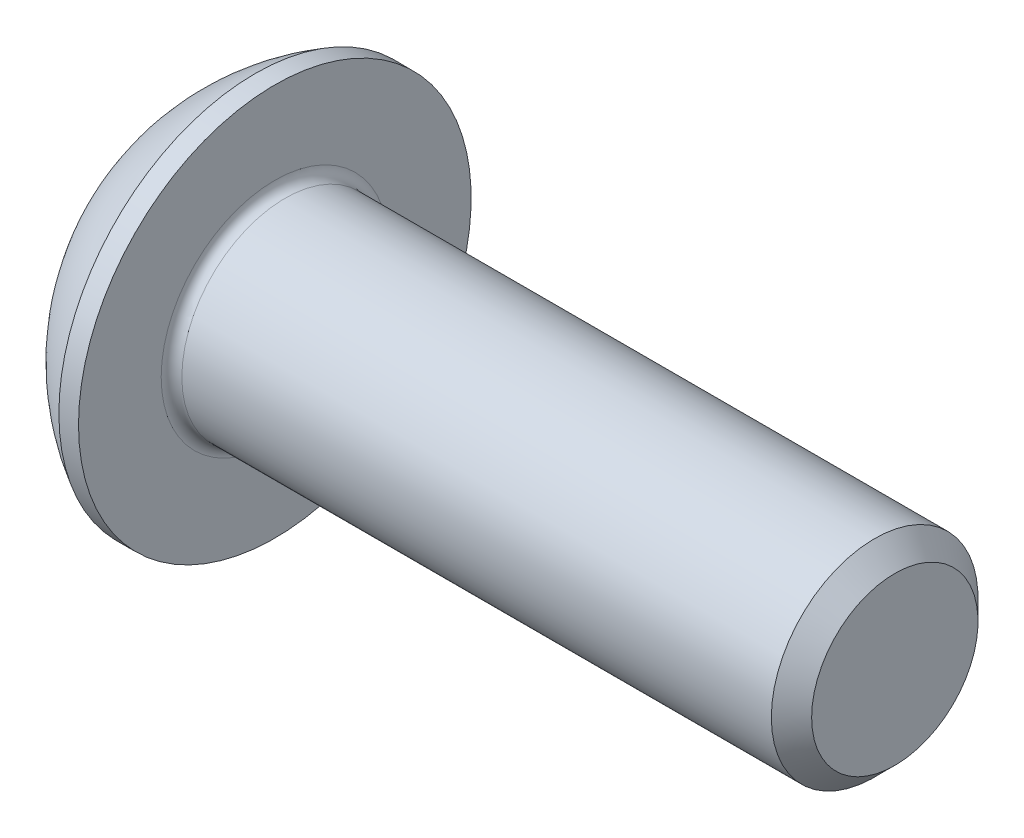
ISO-10303-21;
HEADER;
FILE_DESCRIPTION(('STEP AP214'),'2;1');
FILE_NAME('part.step','',(''),(''),'','','');
FILE_SCHEMA(('AUTOMOTIVE_DESIGN { 1 0 10303 214 1 1 1 1 }'));
ENDSEC;
DATA;
#1=APPLICATION_CONTEXT('core data for automotive mechanical design processes');
#2=APPLICATION_PROTOCOL_DEFINITION('international standard','automotive_design',2000,#1);
#3=PRODUCT_CONTEXT('',#1,'mechanical');
#4=PRODUCT('Part','Part','',(#3));
#5=PRODUCT_RELATED_PRODUCT_CATEGORY('part','',(#4));
#6=PRODUCT_DEFINITION_FORMATION('','',#4);
#7=PRODUCT_DEFINITION_CONTEXT('part definition',#1,'design');
#8=PRODUCT_DEFINITION('design','',#6,#7);
#9=PRODUCT_DEFINITION_SHAPE('','',#8);
#10=(LENGTH_UNIT() NAMED_UNIT(*) SI_UNIT(.MILLI.,.METRE.));
#11=(NAMED_UNIT(*) PLANE_ANGLE_UNIT() SI_UNIT($,.RADIAN.));
#12=(NAMED_UNIT(*) SI_UNIT($,.STERADIAN.) SOLID_ANGLE_UNIT());
#13=UNCERTAINTY_MEASURE_WITH_UNIT(LENGTH_MEASURE(1.E-05),#10,'distance_accuracy_value','');
#14=(GEOMETRIC_REPRESENTATION_CONTEXT(3) GLOBAL_UNCERTAINTY_ASSIGNED_CONTEXT((#13)) GLOBAL_UNIT_ASSIGNED_CONTEXT((#10,
#11,#12)) REPRESENTATION_CONTEXT('',''));
#15=CARTESIAN_POINT('',(0.,0.,0.));
#16=DIRECTION('',(0.,0.,1.));
#17=DIRECTION('',(1.,0.,0.));
#18=AXIS2_PLACEMENT_3D('',#15,#16,#17);
#19=CARTESIAN_POINT('',(0.,0.,0.));
#20=DIRECTION('',(-1.,0.,0.));
#21=DIRECTION('',(0.,0.,1.));
#22=AXIS2_PLACEMENT_3D('',#19,#20,#21);
#23=PLANE('',#22);
#24=CARTESIAN_POINT('',(0.,0.,0.));
#25=DIRECTION('',(-1.,0.,0.));
#26=DIRECTION('',(0.,0.,1.));
#27=AXIS2_PLACEMENT_3D('',#24,#25,#26);
#28=CIRCLE('',#27,1.9);
#29=CARTESIAN_POINT('',(0.,1.9,0.));
#30=VERTEX_POINT('',#29);
#31=EDGE_CURVE('E156',#30,#30,#28,.T.);
#32=ORIENTED_EDGE('',*,*,#31,.T.);
#33=EDGE_LOOP('',(#32));
#34=FACE_BOUND('',#33,.T.);
#35=DIRECTION('',(0.,-1.,0.));
#36=VECTOR('',#35,1.);
#37=CARTESIAN_POINT('',(0.,-0.721687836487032,1.25));
#38=LINE('',#37,#36);
#39=CARTESIAN_POINT('',(0.,0.721687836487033,1.25));
#40=VERTEX_POINT('',#39);
#41=CARTESIAN_POINT('',(0.,-0.721687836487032,1.25));
#42=VERTEX_POINT('',#41);
#43=EDGE_CURVE('E46',#40,#42,#38,.T.);
#44=ORIENTED_EDGE('',*,*,#43,.T.);
#45=DIRECTION('',(0.,-0.5,-0.866025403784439));
#46=VECTOR('',#45,1.);
#47=CARTESIAN_POINT('',(0.,-1.44337567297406,0.));
#48=LINE('',#47,#46);
#49=CARTESIAN_POINT('',(0.,-1.44337567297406,0.));
#50=VERTEX_POINT('',#49);
#51=EDGE_CURVE('E249',#42,#50,#48,.T.);
#52=ORIENTED_EDGE('',*,*,#51,.T.);
#53=DIRECTION('',(0.,0.5,-0.866025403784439));
#54=VECTOR('',#53,1.);
#55=CARTESIAN_POINT('',(0.,-0.721687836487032,-1.25));
#56=LINE('',#55,#54);
#57=CARTESIAN_POINT('',(0.,-0.721687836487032,-1.25));
#58=VERTEX_POINT('',#57);
#59=EDGE_CURVE('E131',#50,#58,#56,.T.);
#60=ORIENTED_EDGE('',*,*,#59,.T.);
#61=DIRECTION('',(0.,1.,0.));
#62=VECTOR('',#61,1.);
#63=CARTESIAN_POINT('',(0.,0.721687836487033,-1.25));
#64=LINE('',#63,#62);
#65=CARTESIAN_POINT('',(0.,0.721687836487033,-1.25));
#66=VERTEX_POINT('',#65);
#67=EDGE_CURVE('E252',#58,#66,#64,.T.);
#68=ORIENTED_EDGE('',*,*,#67,.T.);
#69=DIRECTION('',(0.,0.5,0.866025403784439));
#70=VECTOR('',#69,1.);
#71=CARTESIAN_POINT('',(0.,1.44337567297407,0.));
#72=LINE('',#71,#70);
#73=CARTESIAN_POINT('',(0.,1.44337567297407,0.));
#74=VERTEX_POINT('',#73);
#75=EDGE_CURVE('E254',#66,#74,#72,.T.);
#76=ORIENTED_EDGE('',*,*,#75,.T.);
#77=DIRECTION('',(0.,-0.5,0.866025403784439));
#78=VECTOR('',#77,1.);
#79=CARTESIAN_POINT('',(0.,0.721687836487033,1.25));
#80=LINE('',#79,#78);
#81=EDGE_CURVE('E256',#74,#40,#80,.T.);
#82=ORIENTED_EDGE('',*,*,#81,.T.);
#83=EDGE_LOOP('',(#44,#52,#60,#68,#76,#82));
#84=FACE_BOUND('',#83,.T.);
#85=ADVANCED_FACE('F31',(#34,#84),#23,.T.);
#86=CARTESIAN_POINT('',(3.88527472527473,0.,0.));
#87=DIRECTION('',(-1.,0.,0.));
#88=DIRECTION('',(0.,1.,0.));
#89=AXIS2_PLACEMENT_3D('',#86,#87,#88);
#90=SPHERICAL_SURFACE('',#89,4.3249693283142);
#91=CARTESIAN_POINT('',(1.82,0.,0.));
#92=DIRECTION('',(-1.,0.,0.));
#93=DIRECTION('',(0.,0.,1.));
#94=AXIS2_PLACEMENT_3D('',#91,#92,#93);
#95=CIRCLE('',#94,3.8);
#96=CARTESIAN_POINT('',(1.82,3.8,0.));
#97=VERTEX_POINT('',#96);
#98=EDGE_CURVE('E153',#97,#97,#95,.T.);
#99=CARTESIAN_POINT('',(1.82,3.8,0.));
#100=CARTESIAN_POINT('',(1.79553223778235,3.78670197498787,0.));
#101=CARTESIAN_POINT('',(1.77119294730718,3.77316757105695,0.));
#102=CARTESIAN_POINT('',(1.72278031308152,3.74563119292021,0.));
#103=CARTESIAN_POINT('',(1.69870696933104,3.7316292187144,0.));
#104=CARTESIAN_POINT('',(1.65083523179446,3.7031628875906,0.));
#105=CARTESIAN_POINT('',(1.62703683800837,3.6886985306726,0.));
#106=CARTESIAN_POINT('',(1.57972387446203,3.65931284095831,0.));
#107=CARTESIAN_POINT('',(1.55620930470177,3.64439150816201,0.));
#108=CARTESIAN_POINT('',(1.50947276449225,3.61409743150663,0.));
#109=CARTESIAN_POINT('',(1.48625079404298,3.59872468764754,0.));
#110=CARTESIAN_POINT('',(1.44010811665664,3.56753352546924,0.));
#111=CARTESIAN_POINT('',(1.41718740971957,3.55171510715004,0.));
#112=CARTESIAN_POINT('',(1.37165581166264,3.51963849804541,0.));
#113=CARTESIAN_POINT('',(1.34904492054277,3.50338030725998,0.));
#114=CARTESIAN_POINT('',(1.30414139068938,3.47043021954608,0.));
#115=CARTESIAN_POINT('',(1.28184875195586,3.4537383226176,0.));
#116=CARTESIAN_POINT('',(1.23759004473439,3.41992705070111,0.));
#117=CARTESIAN_POINT('',(1.21562397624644,3.40280767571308,0.));
#118=CARTESIAN_POINT('',(1.17202660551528,3.3681478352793,0.));
#119=CARTESIAN_POINT('',(1.15039530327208,3.35060736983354,0.));
#120=CARTESIAN_POINT('',(1.10747553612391,3.31511189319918,0.));
#121=CARTESIAN_POINT('',(1.08618707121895,3.29715688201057,0.));
#122=CARTESIAN_POINT('',(1.04396092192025,3.26083901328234,0.));
#123=CARTESIAN_POINT('',(1.02302323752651,3.24247615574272,0.));
#124=CARTESIAN_POINT('',(0.981506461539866,3.20534944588,0.));
#125=CARTESIAN_POINT('',(0.960927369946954,3.18658559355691,0.));
#126=CARTESIAN_POINT('',(0.920135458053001,3.14866389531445,0.));
#127=CARTESIAN_POINT('',(0.89992263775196,3.12950604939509,0.));
#128=CARTESIAN_POINT('',(0.859870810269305,3.09080351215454,0.));
#129=CARTESIAN_POINT('',(0.84003180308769,3.07125882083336,0.));
#130=CARTESIAN_POINT('',(0.800735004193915,3.0317898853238,0.));
#131=CARTESIAN_POINT('',(0.781277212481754,3.01186564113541,0.));
#132=CARTESIAN_POINT('',(0.742750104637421,2.97164503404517,0.));
#133=CARTESIAN_POINT('',(0.723680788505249,2.95134867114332,0.));
#134=CARTESIAN_POINT('',(0.685937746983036,2.91039139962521,0.));
#135=CARTESIAN_POINT('',(0.667264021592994,2.88973049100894,0.));
#136=CARTESIAN_POINT('',(0.630319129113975,2.84805183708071,0.));
#137=CARTESIAN_POINT('',(0.612047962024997,2.82703409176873,0.));
#138=CARTESIAN_POINT('',(0.575915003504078,2.78464960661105,0.));
#139=CARTESIAN_POINT('',(0.558053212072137,2.76328286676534,0.));
#140=CARTESIAN_POINT('',(0.52274566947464,2.72020836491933,0.));
#141=CARTESIAN_POINT('',(0.505299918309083,2.69850060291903,0.));
#142=CARTESIAN_POINT('',(0.470830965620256,2.65475215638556,0.));
#143=CARTESIAN_POINT('',(0.453807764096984,2.63271147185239,0.));
#144=CARTESIAN_POINT('',(0.420190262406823,2.58830540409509,0.));
#145=CARTESIAN_POINT('',(0.403595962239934,2.56594002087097,0.));
#146=CARTESIAN_POINT('',(0.370842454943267,2.52089290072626,0.));
#147=CARTESIAN_POINT('',(0.35468324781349,2.49821116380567,0.));
#148=CARTESIAN_POINT('',(0.322805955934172,2.45253979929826,0.));
#149=CARTESIAN_POINT('',(0.307087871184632,2.42955017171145,0.));
#150=CARTESIAN_POINT('',(0.276098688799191,2.38327160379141,0.));
#151=CARTESIAN_POINT('',(0.26082759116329,2.35998266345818,0.));
#152=CARTESIAN_POINT('',(0.230738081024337,2.31311415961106,0.));
#153=CARTESIAN_POINT('',(0.215919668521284,2.28953459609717,0.));
#154=CARTESIAN_POINT('',(0.186741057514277,2.24209364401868,0.));
#155=CARTESIAN_POINT('',(0.172380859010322,2.21823225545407,0.));
#156=CARTESIAN_POINT('',(0.144124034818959,2.17023655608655,0.));
#157=CARTESIAN_POINT('',(0.130227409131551,2.14610224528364,0.));
#158=CARTESIAN_POINT('',(0.102902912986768,2.09756970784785,0.));
#159=CARTESIAN_POINT('',(0.0894750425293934,2.07317148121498,0.));
#160=CARTESIAN_POINT('',(0.0630930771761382,2.02412021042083,0.));
#161=CARTESIAN_POINT('',(0.0501389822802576,1.99946716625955,0.));
#162=CARTESIAN_POINT('',(0.0247093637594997,1.94991547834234,0.));
#163=CARTESIAN_POINT('',(0.0122338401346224,1.9250168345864,0.));
#164=CARTESIAN_POINT('',(0.,1.9,0.));
#165=B_SPLINE_CURVE_WITH_KNOTS('',3,(#99,#100,#101,#102,#103,#104,#105,#106,#107,#108,#109,#110,
#111,#112,#113,#114,#115,#116,#117,#118,#119,#120,#121,#122,#123,#124,#125,#126,#127,#128,#129,
#130,#131,#132,#133,#134,#135,#136,#137,#138,#139,#140,#141,#142,#143,#144,#145,#146,#147,#148,
#149,#150,#151,#152,#153,#154,#155,#156,#157,#158,#159,#160,#161,#162,#163,#164),.UNSPECIFIED.,
.F.,.F.,(4,2,2,2,2,2,2,2,2,2,2,2,2,2,2,2,2,2,2,2,2,2,2,2,2,2,2,2,2,2,2,2,4),(0.,
0.0835425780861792,0.167085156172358,0.250627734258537,0.334170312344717,0.417712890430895,
0.501255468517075,0.584798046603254,0.668340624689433,0.751883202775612,0.835425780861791,
0.91896835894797,1.00251093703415,1.08605351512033,1.16959609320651,1.25313867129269,
1.33668124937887,1.42022382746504,1.50376640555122,1.5873089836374,1.67085156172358,
1.75439413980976,1.83793671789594,1.92147929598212,2.0050218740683,2.08856445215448,
2.17210703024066,2.25564960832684,2.33919218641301,2.42273476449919,2.50627734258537,
2.58981992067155,2.67336249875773),.UNSPECIFIED.);
#166=EDGE_CURVE('BSEAM177',#97,#30,#165,.T.);
#167=ORIENTED_EDGE('',*,*,#98,.T.);
#168=ORIENTED_EDGE('',*,*,#31,.F.);
#169=ORIENTED_EDGE('',*,*,#166,.T.);
#170=ORIENTED_EDGE('',*,*,#166,.F.);
#171=EDGE_LOOP('',(#167,#169,#168,#170));
#172=FACE_BOUND('',#171,.T.);
#173=ADVANCED_FACE('F177',(#172),#90,.T.);
#174=CARTESIAN_POINT('',(0.,0.,0.));
#175=DIRECTION('',(-1.,0.,0.));
#176=DIRECTION('',(0.,0.,1.));
#177=AXIS2_PLACEMENT_3D('',#174,#175,#176);
#178=CYLINDRICAL_SURFACE('',#177,3.8);
#179=ORIENTED_EDGE('',*,*,#98,.F.);
#180=EDGE_LOOP('',(#179));
#181=FACE_BOUND('',#180,.T.);
#182=CARTESIAN_POINT('',(2.2,0.,0.));
#183=DIRECTION('',(-1.,0.,0.));
#184=DIRECTION('',(0.,0.,1.));
#185=AXIS2_PLACEMENT_3D('',#182,#183,#184);
#186=CIRCLE('',#185,3.8);
#187=CARTESIAN_POINT('',(2.2,0.,3.8));
#188=VERTEX_POINT('',#187);
#189=EDGE_CURVE('E150',#188,#188,#186,.T.);
#190=ORIENTED_EDGE('',*,*,#189,.T.);
#191=EDGE_LOOP('',(#190));
#192=FACE_BOUND('',#191,.T.);
#193=ADVANCED_FACE('F182',(#181,#192),#178,.T.);
#194=CARTESIAN_POINT('',(2.2,2.,0.));
#195=DIRECTION('',(-1.,0.,0.));
#196=DIRECTION('',(0.,0.,1.));
#197=AXIS2_PLACEMENT_3D('',#194,#195,#196);
#198=PLANE('',#197);
#199=CARTESIAN_POINT('',(2.2,0.,0.));
#200=DIRECTION('',(-1.,0.,0.));
#201=DIRECTION('',(0.,0.,1.));
#202=AXIS2_PLACEMENT_3D('',#199,#200,#201);
#203=CIRCLE('',#202,2.2);
#204=CARTESIAN_POINT('',(2.2,0.,2.2));
#205=VERTEX_POINT('',#204);
#206=EDGE_CURVE('E39',#205,#205,#203,.T.);
#207=ORIENTED_EDGE('',*,*,#206,.T.);
#208=EDGE_LOOP('',(#207));
#209=FACE_BOUND('',#208,.T.);
#210=ORIENTED_EDGE('',*,*,#189,.F.);
#211=EDGE_LOOP('',(#210));
#212=FACE_BOUND('',#211,.T.);
#213=ADVANCED_FACE('F161',(#209,#212),#198,.F.);
#214=CARTESIAN_POINT('',(0.,0.,0.));
#215=DIRECTION('',(-1.,0.,0.));
#216=DIRECTION('',(0.,0.,1.));
#217=AXIS2_PLACEMENT_3D('',#214,#215,#216);
#218=CYLINDRICAL_SURFACE('',#217,2.);
#219=CARTESIAN_POINT('',(2.4,0.,0.));
#220=DIRECTION('',(-1.,0.,0.));
#221=DIRECTION('',(0.,0.,1.));
#222=AXIS2_PLACEMENT_3D('',#219,#220,#221);
#223=CIRCLE('',#222,2.);
#224=CARTESIAN_POINT('',(2.4,0.,2.));
#225=VERTEX_POINT('',#224);
#226=EDGE_CURVE('E11',#225,#225,#223,.F.);
#227=ORIENTED_EDGE('',*,*,#226,.T.);
#228=EDGE_LOOP('',(#227));
#229=FACE_BOUND('',#228,.T.);
#230=CARTESIAN_POINT('',(13.81,0.,0.));
#231=DIRECTION('',(-1.,0.,0.));
#232=DIRECTION('',(0.,0.,1.));
#233=AXIS2_PLACEMENT_3D('',#230,#231,#232);
#234=CIRCLE('',#233,2.);
#235=CARTESIAN_POINT('',(13.81,0.,2.));
#236=VERTEX_POINT('',#235);
#237=EDGE_CURVE('E147',#236,#236,#234,.T.);
#238=ORIENTED_EDGE('',*,*,#237,.T.);
#239=EDGE_LOOP('',(#238));
#240=FACE_BOUND('',#239,.T.);
#241=ADVANCED_FACE('F191',(#229,#240),#218,.T.);
#242=CARTESIAN_POINT('',(14.2,0.,0.));
#243=DIRECTION('',(-1.,0.,0.));
#244=DIRECTION('',(0.,0.,1.));
#245=AXIS2_PLACEMENT_3D('',#242,#243,#244);
#246=CONICAL_SURFACE('',#245,1.61,0.785398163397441);
#247=ORIENTED_EDGE('',*,*,#237,.F.);
#248=EDGE_LOOP('',(#247));
#249=FACE_BOUND('',#248,.T.);
#250=CARTESIAN_POINT('',(14.2,0.,0.));
#251=DIRECTION('',(-1.,0.,0.));
#252=DIRECTION('',(0.,0.,1.));
#253=AXIS2_PLACEMENT_3D('',#250,#251,#252);
#254=CIRCLE('',#253,1.61);
#255=CARTESIAN_POINT('',(14.2,0.,1.61));
#256=VERTEX_POINT('',#255);
#257=EDGE_CURVE('E143',#256,#256,#254,.T.);
#258=ORIENTED_EDGE('',*,*,#257,.T.);
#259=EDGE_LOOP('',(#258));
#260=FACE_BOUND('',#259,.T.);
#261=ADVANCED_FACE('F172',(#249,#260),#246,.T.);
#262=CARTESIAN_POINT('',(14.2,0.,0.));
#263=DIRECTION('',(-1.,0.,0.));
#264=DIRECTION('',(0.,0.,1.));
#265=AXIS2_PLACEMENT_3D('',#262,#263,#264);
#266=PLANE('',#265);
#267=ORIENTED_EDGE('',*,*,#257,.F.);
#268=EDGE_LOOP('',(#267));
#269=FACE_BOUND('',#268,.T.);
#270=ADVANCED_FACE('F165',(#269),#266,.F.);
#271=CARTESIAN_POINT('',(2.4,0.,0.));
#272=DIRECTION('',(-1.,0.,0.));
#273=DIRECTION('',(0.,0.,1.));
#274=AXIS2_PLACEMENT_3D('',#271,#272,#273);
#275=TOROIDAL_SURFACE('',#274,2.2,0.2);
#276=ORIENTED_EDGE('',*,*,#226,.F.);
#277=EDGE_LOOP('',(#276));
#278=FACE_BOUND('',#277,.T.);
#279=ORIENTED_EDGE('',*,*,#206,.F.);
#280=EDGE_LOOP('',(#279));
#281=FACE_BOUND('',#280,.T.);
#282=ADVANCED_FACE('F33',(#278,#281),#275,.F.);
#283=CARTESIAN_POINT('',(1.3,-1.44337567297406,0.));
#284=DIRECTION('',(0.,0.866025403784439,-0.5));
#285=DIRECTION('',(0.,0.5,0.866025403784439));
#286=AXIS2_PLACEMENT_3D('',#283,#284,#285);
#287=PLANE('',#286);
#288=DIRECTION('',(0.,-0.5,-0.866025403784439));
#289=VECTOR('',#288,1.);
#290=CARTESIAN_POINT('',(1.3,-1.44337567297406,0.));
#291=LINE('',#290,#289);
#292=CARTESIAN_POINT('',(1.3,-0.721687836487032,1.25));
#293=VERTEX_POINT('',#292);
#294=CARTESIAN_POINT('',(1.3,-1.08253175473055,0.625));
#295=VERTEX_POINT('',#294);
#296=EDGE_CURVE('E114',#293,#295,#291,.T.);
#297=ORIENTED_EDGE('',*,*,#296,.T.);
#298=CARTESIAN_POINT('',(1.3,-1.44337567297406,0.));
#299=VERTEX_POINT('',#298);
#300=EDGE_CURVE('E107',#295,#299,#291,.T.);
#301=ORIENTED_EDGE('',*,*,#300,.T.);
#302=DIRECTION('',(-1.,0.,0.));
#303=VECTOR('',#302,1.);
#304=CARTESIAN_POINT('',(1.3,-1.44337567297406,0.));
#305=LINE('',#304,#303);
#306=EDGE_CURVE('E111',#299,#50,#305,.T.);
#307=ORIENTED_EDGE('',*,*,#306,.T.);
#308=ORIENTED_EDGE('',*,*,#51,.F.);
#309=DIRECTION('',(-1.,0.,0.));
#310=VECTOR('',#309,1.);
#311=CARTESIAN_POINT('',(1.3,-0.721687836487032,1.25));
#312=LINE('',#311,#310);
#313=EDGE_CURVE('E239',#293,#42,#312,.T.);
#314=ORIENTED_EDGE('',*,*,#313,.F.);
#315=EDGE_LOOP('',(#297,#301,#307,#308,#314));
#316=FACE_BOUND('',#315,.T.);
#317=ADVANCED_FACE('F109',(#316),#287,.T.);
#318=CARTESIAN_POINT('',(1.3,-0.721687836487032,-1.25));
#319=DIRECTION('',(0.,0.866025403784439,0.5));
#320=DIRECTION('',(0.,-0.5,0.866025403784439));
#321=AXIS2_PLACEMENT_3D('',#318,#319,#320);
#322=PLANE('',#321);
#323=DIRECTION('',(0.,0.5,-0.866025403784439));
#324=VECTOR('',#323,1.);
#325=CARTESIAN_POINT('',(1.3,-0.721687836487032,-1.25));
#326=LINE('',#325,#324);
#327=CARTESIAN_POINT('',(1.3,-1.08253175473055,-0.625));
#328=VERTEX_POINT('',#327);
#329=EDGE_CURVE('E119',#299,#328,#326,.T.);
#330=ORIENTED_EDGE('',*,*,#329,.T.);
#331=CARTESIAN_POINT('',(1.3,-0.721687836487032,-1.25));
#332=VERTEX_POINT('',#331);
#333=EDGE_CURVE('E126',#328,#332,#326,.T.);
#334=ORIENTED_EDGE('',*,*,#333,.T.);
#335=DIRECTION('',(-1.,0.,0.));
#336=VECTOR('',#335,1.);
#337=CARTESIAN_POINT('',(1.3,-0.721687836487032,-1.25));
#338=LINE('',#337,#336);
#339=EDGE_CURVE('E133',#332,#58,#338,.T.);
#340=ORIENTED_EDGE('',*,*,#339,.T.);
#341=ORIENTED_EDGE('',*,*,#59,.F.);
#342=ORIENTED_EDGE('',*,*,#306,.F.);
#343=EDGE_LOOP('',(#330,#334,#340,#341,#342));
#344=FACE_BOUND('',#343,.T.);
#345=ADVANCED_FACE('F129',(#344),#322,.T.);
#346=CARTESIAN_POINT('',(1.3,0.721687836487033,-1.25));
#347=DIRECTION('',(0.,0.,1.));
#348=DIRECTION('',(1.,0.,0.));
#349=AXIS2_PLACEMENT_3D('',#346,#347,#348);
#350=PLANE('',#349);
#351=DIRECTION('',(0.,1.,0.));
#352=VECTOR('',#351,1.);
#353=CARTESIAN_POINT('',(1.3,0.721687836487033,-1.25));
#354=LINE('',#353,#352);
#355=CARTESIAN_POINT('',(1.3,0.,-1.25));
#356=VERTEX_POINT('',#355);
#357=EDGE_CURVE('E275',#332,#356,#354,.T.);
#358=ORIENTED_EDGE('',*,*,#357,.T.);
#359=CARTESIAN_POINT('',(1.3,0.721687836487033,-1.25));
#360=VERTEX_POINT('',#359);
#361=EDGE_CURVE('E125',#356,#360,#354,.T.);
#362=ORIENTED_EDGE('',*,*,#361,.T.);
#363=DIRECTION('',(-1.,0.,0.));
#364=VECTOR('',#363,1.);
#365=CARTESIAN_POINT('',(1.3,0.721687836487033,-1.25));
#366=LINE('',#365,#364);
#367=EDGE_CURVE('E138',#360,#66,#366,.T.);
#368=ORIENTED_EDGE('',*,*,#367,.T.);
#369=ORIENTED_EDGE('',*,*,#67,.F.);
#370=ORIENTED_EDGE('',*,*,#339,.F.);
#371=EDGE_LOOP('',(#358,#362,#368,#369,#370));
#372=FACE_BOUND('',#371,.T.);
#373=ADVANCED_FACE('F205',(#372),#350,.T.);
#374=CARTESIAN_POINT('',(1.3,1.44337567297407,0.));
#375=DIRECTION('',(0.,-0.866025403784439,0.5));
#376=DIRECTION('',(0.,-0.5,-0.866025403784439));
#377=AXIS2_PLACEMENT_3D('',#374,#375,#376);
#378=PLANE('',#377);
#379=DIRECTION('',(0.,0.5,0.866025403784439));
#380=VECTOR('',#379,1.);
#381=CARTESIAN_POINT('',(1.3,1.44337567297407,0.));
#382=LINE('',#381,#380);
#383=CARTESIAN_POINT('',(1.3,1.08253175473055,-0.625));
#384=VERTEX_POINT('',#383);
#385=EDGE_CURVE('E281',#360,#384,#382,.T.);
#386=ORIENTED_EDGE('',*,*,#385,.T.);
#387=CARTESIAN_POINT('',(1.3,1.44337567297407,0.));
#388=VERTEX_POINT('',#387);
#389=EDGE_CURVE('E279',#384,#388,#382,.T.);
#390=ORIENTED_EDGE('',*,*,#389,.T.);
#391=DIRECTION('',(-1.,0.,0.));
#392=VECTOR('',#391,1.);
#393=CARTESIAN_POINT('',(1.3,1.44337567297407,0.));
#394=LINE('',#393,#392);
#395=EDGE_CURVE('E261',#388,#74,#394,.T.);
#396=ORIENTED_EDGE('',*,*,#395,.T.);
#397=ORIENTED_EDGE('',*,*,#75,.F.);
#398=ORIENTED_EDGE('',*,*,#367,.F.);
#399=EDGE_LOOP('',(#386,#390,#396,#397,#398));
#400=FACE_BOUND('',#399,.T.);
#401=ADVANCED_FACE('F208',(#400),#378,.T.);
#402=CARTESIAN_POINT('',(1.3,0.721687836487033,1.25));
#403=DIRECTION('',(0.,-0.866025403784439,-0.5));
#404=DIRECTION('',(0.,0.5,-0.866025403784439));
#405=AXIS2_PLACEMENT_3D('',#402,#403,#404);
#406=PLANE('',#405);
#407=DIRECTION('',(0.,-0.5,0.866025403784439));
#408=VECTOR('',#407,1.);
#409=CARTESIAN_POINT('',(1.3,0.721687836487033,1.25));
#410=LINE('',#409,#408);
#411=CARTESIAN_POINT('',(1.3,1.08253175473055,0.625000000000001));
#412=VERTEX_POINT('',#411);
#413=EDGE_CURVE('E245',#388,#412,#410,.T.);
#414=ORIENTED_EDGE('',*,*,#413,.T.);
#415=CARTESIAN_POINT('',(1.3,0.721687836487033,1.25));
#416=VERTEX_POINT('',#415);
#417=EDGE_CURVE('E237',#412,#416,#410,.T.);
#418=ORIENTED_EDGE('',*,*,#417,.T.);
#419=DIRECTION('',(-1.,0.,0.));
#420=VECTOR('',#419,1.);
#421=CARTESIAN_POINT('',(1.3,0.721687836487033,1.25));
#422=LINE('',#421,#420);
#423=EDGE_CURVE('E243',#416,#40,#422,.T.);
#424=ORIENTED_EDGE('',*,*,#423,.T.);
#425=ORIENTED_EDGE('',*,*,#81,.F.);
#426=ORIENTED_EDGE('',*,*,#395,.F.);
#427=EDGE_LOOP('',(#414,#418,#424,#425,#426));
#428=FACE_BOUND('',#427,.T.);
#429=ADVANCED_FACE('F212',(#428),#406,.T.);
#430=CARTESIAN_POINT('',(1.3,-0.721687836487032,1.25));
#431=DIRECTION('',(0.,0.,-1.));
#432=DIRECTION('',(-1.,0.,0.));
#433=AXIS2_PLACEMENT_3D('',#430,#431,#432);
#434=PLANE('',#433);
#435=DIRECTION('',(0.,-1.,0.));
#436=VECTOR('',#435,1.);
#437=CARTESIAN_POINT('',(1.3,-0.721687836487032,1.25));
#438=LINE('',#437,#436);
#439=CARTESIAN_POINT('',(1.3,0.,1.25));
#440=VERTEX_POINT('',#439);
#441=EDGE_CURVE('E54',#416,#440,#438,.T.);
#442=ORIENTED_EDGE('',*,*,#441,.T.);
#443=EDGE_CURVE('E240',#440,#293,#438,.T.);
#444=ORIENTED_EDGE('',*,*,#443,.T.);
#445=ORIENTED_EDGE('',*,*,#313,.T.);
#446=ORIENTED_EDGE('',*,*,#43,.F.);
#447=ORIENTED_EDGE('',*,*,#423,.F.);
#448=EDGE_LOOP('',(#442,#444,#445,#446,#447));
#449=FACE_BOUND('',#448,.T.);
#450=ADVANCED_FACE('F216',(#449),#434,.T.);
#451=CARTESIAN_POINT('',(1.3,0.,2.5));
#452=DIRECTION('',(-1.,0.,0.));
#453=DIRECTION('',(0.,0.,1.));
#454=AXIS2_PLACEMENT_3D('',#451,#452,#453);
#455=PLANE('',#454);
#456=ORIENTED_EDGE('',*,*,#441,.F.);
#457=ORIENTED_EDGE('',*,*,#417,.F.);
#458=CARTESIAN_POINT('',(1.3,0.,0.));
#459=DIRECTION('',(-1.,0.,0.));
#460=DIRECTION('',(0.,0.,1.));
#461=AXIS2_PLACEMENT_3D('',#458,#459,#460);
#462=CIRCLE('',#461,1.25);
#463=EDGE_CURVE('E137',#440,#412,#462,.T.);
#464=ORIENTED_EDGE('',*,*,#463,.F.);
#465=EDGE_LOOP('',(#456,#457,#464));
#466=FACE_BOUND('',#465,.T.);
#467=ADVANCED_FACE('F220',(#466),#455,.T.);
#468=ORIENTED_EDGE('',*,*,#413,.F.);
#469=ORIENTED_EDGE('',*,*,#389,.F.);
#470=EDGE_CURVE('E144',#412,#384,#462,.T.);
#471=ORIENTED_EDGE('',*,*,#470,.F.);
#472=EDGE_LOOP('',(#468,#469,#471));
#473=FACE_BOUND('',#472,.T.);
#474=ADVANCED_FACE('F228',(#473),#455,.T.);
#475=ORIENTED_EDGE('',*,*,#385,.F.);
#476=ORIENTED_EDGE('',*,*,#361,.F.);
#477=EDGE_CURVE('E286',#384,#356,#462,.T.);
#478=ORIENTED_EDGE('',*,*,#477,.F.);
#479=EDGE_LOOP('',(#475,#476,#478));
#480=FACE_BOUND('',#479,.T.);
#481=ADVANCED_FACE('F233',(#480),#455,.T.);
#482=ORIENTED_EDGE('',*,*,#357,.F.);
#483=ORIENTED_EDGE('',*,*,#333,.F.);
#484=EDGE_CURVE('E278',#356,#328,#462,.T.);
#485=ORIENTED_EDGE('',*,*,#484,.F.);
#486=EDGE_LOOP('',(#482,#483,#485));
#487=FACE_BOUND('',#486,.T.);
#488=ADVANCED_FACE('F226',(#487),#455,.T.);
#489=ORIENTED_EDGE('',*,*,#329,.F.);
#490=ORIENTED_EDGE('',*,*,#300,.F.);
#491=EDGE_CURVE('E121',#328,#295,#462,.T.);
#492=ORIENTED_EDGE('',*,*,#491,.F.);
#493=EDGE_LOOP('',(#489,#490,#492));
#494=FACE_BOUND('',#493,.T.);
#495=ADVANCED_FACE('F120',(#494),#455,.T.);
#496=ORIENTED_EDGE('',*,*,#296,.F.);
#497=ORIENTED_EDGE('',*,*,#443,.F.);
#498=EDGE_CURVE('E132',#295,#440,#462,.T.);
#499=ORIENTED_EDGE('',*,*,#498,.F.);
#500=EDGE_LOOP('',(#496,#497,#499));
#501=FACE_BOUND('',#500,.T.);
#502=ADVANCED_FACE('F200',(#501),#455,.T.);
#503=CARTESIAN_POINT('',(2.02168783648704,0.,0.));
#504=DIRECTION('',(-1.,0.,0.));
#505=DIRECTION('',(0.,0.,1.));
#506=AXIS2_PLACEMENT_3D('',#503,#504,#505);
#507=CONICAL_SURFACE('',#506,0.,1.04719755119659);
#508=ORIENTED_EDGE('',*,*,#463,.T.);
#509=ORIENTED_EDGE('',*,*,#470,.T.);
#510=ORIENTED_EDGE('',*,*,#477,.T.);
#511=ORIENTED_EDGE('',*,*,#484,.T.);
#512=ORIENTED_EDGE('',*,*,#491,.T.);
#513=ORIENTED_EDGE('',*,*,#498,.T.);
#514=EDGE_LOOP('',(#508,#509,#510,#511,#512,#513));
#515=FACE_BOUND('',#514,.T.);
#516=CARTESIAN_POINT('',(2.02168783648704,0.,0.));
#517=VERTEX_POINT('',#516);
#518=VERTEX_LOOP('',#517);
#519=FACE_BOUND('',#518,.T.);
#520=ADVANCED_FACE('F198',(#515,#519),#507,.F.);
#521=CLOSED_SHELL('',(#85,#173,#193,#213,#241,#261,#270,#282,#317,#345,#373,#401,#429,#450,#467,
#474,#481,#488,#495,#502,#520));
#522=MANIFOLD_SOLID_BREP('B2',#521);
#523=ADVANCED_BREP_SHAPE_REPRESENTATION('',(#18,#522),#14);
#524=SHAPE_DEFINITION_REPRESENTATION(#9,#523);
ENDSEC;
END-ISO-10303-21;
